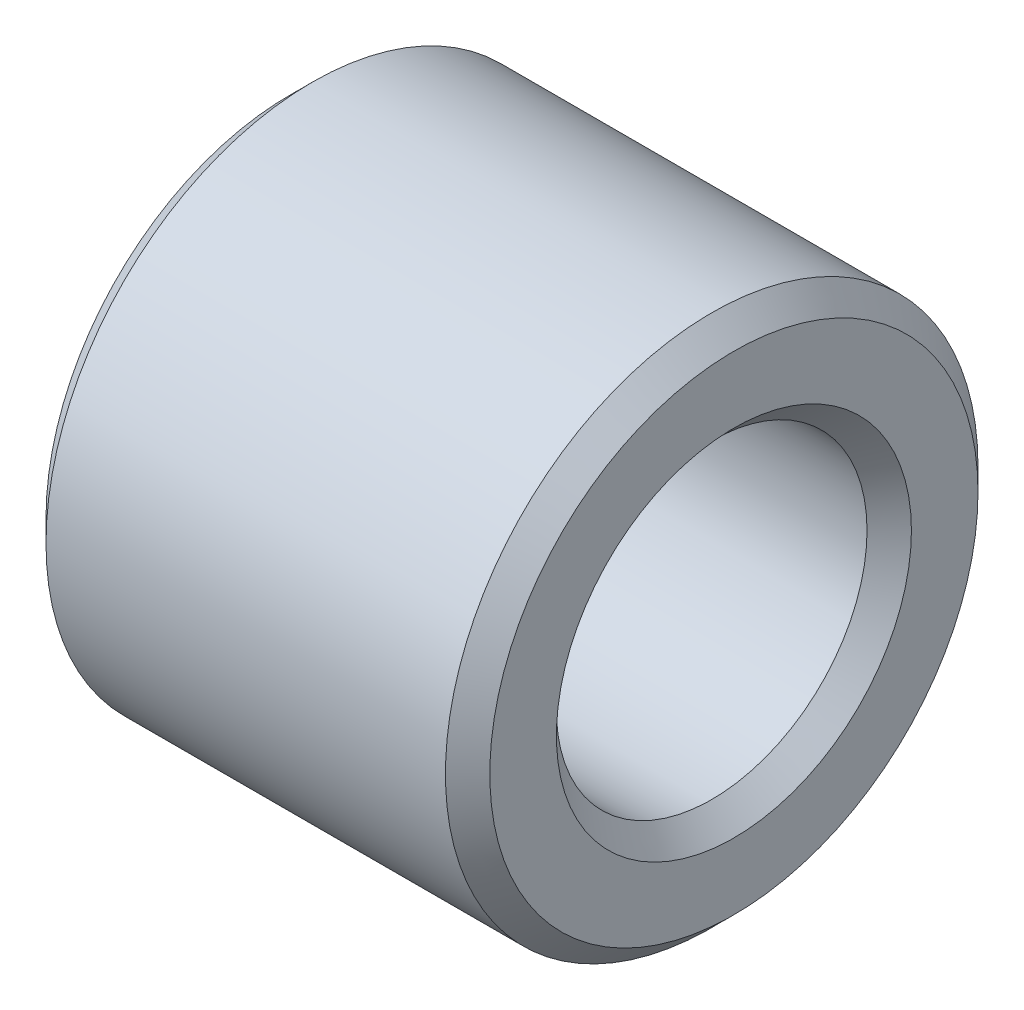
ISO-10303-21;
HEADER;
FILE_DESCRIPTION(('STEP AP214'),'2;1');
FILE_NAME('part.step','',(''),(''),'','','');
FILE_SCHEMA(('AUTOMOTIVE_DESIGN { 1 0 10303 214 1 1 1 1 }'));
ENDSEC;
DATA;
#1=APPLICATION_CONTEXT('core data for automotive mechanical design processes');
#2=APPLICATION_PROTOCOL_DEFINITION('international standard','automotive_design',2000,#1);
#3=PRODUCT_CONTEXT('',#1,'mechanical');
#4=PRODUCT('Part','Part','',(#3));
#5=PRODUCT_RELATED_PRODUCT_CATEGORY('part','',(#4));
#6=PRODUCT_DEFINITION_FORMATION('','',#4);
#7=PRODUCT_DEFINITION_CONTEXT('part definition',#1,'design');
#8=PRODUCT_DEFINITION('design','',#6,#7);
#9=PRODUCT_DEFINITION_SHAPE('','',#8);
#10=(LENGTH_UNIT() NAMED_UNIT(*) SI_UNIT(.MILLI.,.METRE.));
#11=(NAMED_UNIT(*) PLANE_ANGLE_UNIT() SI_UNIT($,.RADIAN.));
#12=(NAMED_UNIT(*) SI_UNIT($,.STERADIAN.) SOLID_ANGLE_UNIT());
#13=UNCERTAINTY_MEASURE_WITH_UNIT(LENGTH_MEASURE(1.E-05),#10,'distance_accuracy_value','');
#14=(GEOMETRIC_REPRESENTATION_CONTEXT(3) GLOBAL_UNCERTAINTY_ASSIGNED_CONTEXT((#13)) GLOBAL_UNIT_ASSIGNED_CONTEXT((#10,
#11,#12)) REPRESENTATION_CONTEXT('',''));
#15=CARTESIAN_POINT('',(0.,0.,0.));
#16=DIRECTION('',(0.,0.,1.));
#17=DIRECTION('',(1.,0.,0.));
#18=AXIS2_PLACEMENT_3D('',#15,#16,#17);
#19=CARTESIAN_POINT('',(0.,3.5,0.));
#20=DIRECTION('',(1.,0.,0.));
#21=DIRECTION('',(0.,0.,-1.));
#22=AXIS2_PLACEMENT_3D('',#19,#20,#21);
#23=PLANE('',#22);
#24=CARTESIAN_POINT('',(0.,0.,0.));
#25=DIRECTION('',(1.,0.,0.));
#26=DIRECTION('',(0.,0.,-1.));
#27=AXIS2_PLACEMENT_3D('',#24,#25,#26);
#28=CIRCLE('',#27,5.5);
#29=CARTESIAN_POINT('',(0.,0.,-5.5));
#30=VERTEX_POINT('',#29);
#31=EDGE_CURVE('E10',#30,#30,#28,.T.);
#32=ORIENTED_EDGE('',*,*,#31,.T.);
#33=EDGE_LOOP('',(#32));
#34=FACE_BOUND('',#33,.T.);
#35=CARTESIAN_POINT('',(0.,0.,0.));
#36=DIRECTION('',(1.,0.,0.));
#37=DIRECTION('',(0.,0.,-1.));
#38=AXIS2_PLACEMENT_3D('',#35,#36,#37);
#39=CIRCLE('',#38,4.);
#40=CARTESIAN_POINT('',(0.,0.,-4.));
#41=VERTEX_POINT('',#40);
#42=EDGE_CURVE('E42',#41,#41,#39,.F.);
#43=ORIENTED_EDGE('',*,*,#42,.T.);
#44=EDGE_LOOP('',(#43));
#45=FACE_BOUND('',#44,.T.);
#46=ADVANCED_FACE('F35',(#34,#45),#23,.T.);
#47=CARTESIAN_POINT('',(0.,0.,0.));
#48=DIRECTION('',(1.,0.,0.));
#49=DIRECTION('',(0.,0.,-1.));
#50=AXIS2_PLACEMENT_3D('',#47,#48,#49);
#51=CYLINDRICAL_SURFACE('',#50,6.);
#52=CARTESIAN_POINT('',(-9.5,0.,0.));
#53=DIRECTION('',(-1.,0.,0.));
#54=DIRECTION('',(0.,0.,1.));
#55=AXIS2_PLACEMENT_3D('',#52,#53,#54);
#56=CIRCLE('',#55,6.);
#57=CARTESIAN_POINT('',(-9.5,0.,6.));
#58=VERTEX_POINT('',#57);
#59=EDGE_CURVE('E46',#58,#58,#56,.F.);
#60=ORIENTED_EDGE('',*,*,#59,.T.);
#61=EDGE_LOOP('',(#60));
#62=FACE_BOUND('',#61,.T.);
#63=CARTESIAN_POINT('',(-0.499999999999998,0.,0.));
#64=DIRECTION('',(1.,0.,0.));
#65=DIRECTION('',(0.,0.,-1.));
#66=AXIS2_PLACEMENT_3D('',#63,#64,#65);
#67=CIRCLE('',#66,6.);
#68=CARTESIAN_POINT('',(-0.499999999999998,0.,-6.));
#69=VERTEX_POINT('',#68);
#70=EDGE_CURVE('E50',#69,#69,#67,.F.);
#71=ORIENTED_EDGE('',*,*,#70,.T.);
#72=EDGE_LOOP('',(#71));
#73=FACE_BOUND('',#72,.T.);
#74=ADVANCED_FACE('F78',(#62,#73),#51,.T.);
#75=CARTESIAN_POINT('',(-10.,3.5,0.));
#76=DIRECTION('',(-1.,0.,0.));
#77=DIRECTION('',(0.,0.,1.));
#78=AXIS2_PLACEMENT_3D('',#75,#76,#77);
#79=PLANE('',#78);
#80=CARTESIAN_POINT('',(-10.,0.,0.));
#81=DIRECTION('',(-1.,0.,0.));
#82=DIRECTION('',(0.,0.,1.));
#83=AXIS2_PLACEMENT_3D('',#80,#81,#82);
#84=CIRCLE('',#83,4.);
#85=CARTESIAN_POINT('',(-10.,0.,4.));
#86=VERTEX_POINT('',#85);
#87=EDGE_CURVE('E61',#86,#86,#84,.F.);
#88=ORIENTED_EDGE('',*,*,#87,.T.);
#89=EDGE_LOOP('',(#88));
#90=FACE_BOUND('',#89,.T.);
#91=CARTESIAN_POINT('',(-10.,0.,0.));
#92=DIRECTION('',(-1.,0.,0.));
#93=DIRECTION('',(0.,0.,1.));
#94=AXIS2_PLACEMENT_3D('',#91,#92,#93);
#95=CIRCLE('',#94,5.5);
#96=CARTESIAN_POINT('',(-10.,0.,5.5));
#97=VERTEX_POINT('',#96);
#98=EDGE_CURVE('E64',#97,#97,#95,.T.);
#99=ORIENTED_EDGE('',*,*,#98,.T.);
#100=EDGE_LOOP('',(#99));
#101=FACE_BOUND('',#100,.T.);
#102=ADVANCED_FACE('F68',(#90,#101),#79,.T.);
#103=CARTESIAN_POINT('',(0.,0.,0.));
#104=DIRECTION('',(1.,0.,0.));
#105=DIRECTION('',(0.,0.,-1.));
#106=AXIS2_PLACEMENT_3D('',#103,#104,#105);
#107=CYLINDRICAL_SURFACE('',#106,3.5);
#108=CARTESIAN_POINT('',(-9.5,0.,0.));
#109=DIRECTION('',(-1.,0.,0.));
#110=DIRECTION('',(0.,0.,1.));
#111=AXIS2_PLACEMENT_3D('',#108,#109,#110);
#112=CIRCLE('',#111,3.5);
#113=CARTESIAN_POINT('',(-9.5,0.,3.5));
#114=VERTEX_POINT('',#113);
#115=EDGE_CURVE('E55',#114,#114,#112,.T.);
#116=ORIENTED_EDGE('',*,*,#115,.T.);
#117=EDGE_LOOP('',(#116));
#118=FACE_BOUND('',#117,.T.);
#119=CARTESIAN_POINT('',(-0.5,0.,0.));
#120=DIRECTION('',(1.,0.,0.));
#121=DIRECTION('',(0.,0.,-1.));
#122=AXIS2_PLACEMENT_3D('',#119,#120,#121);
#123=CIRCLE('',#122,3.5);
#124=CARTESIAN_POINT('',(-0.5,0.,-3.5));
#125=VERTEX_POINT('',#124);
#126=EDGE_CURVE('E58',#125,#125,#123,.T.);
#127=ORIENTED_EDGE('',*,*,#126,.T.);
#128=EDGE_LOOP('',(#127));
#129=FACE_BOUND('',#128,.T.);
#130=ADVANCED_FACE('F97',(#118,#129),#107,.F.);
#131=CARTESIAN_POINT('',(-10.,0.,0.));
#132=DIRECTION('',(-1.,0.,0.));
#133=DIRECTION('',(0.,0.,1.));
#134=AXIS2_PLACEMENT_3D('',#131,#132,#133);
#135=CONICAL_SURFACE('',#134,4.,0.785398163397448);
#136=ORIENTED_EDGE('',*,*,#115,.F.);
#137=EDGE_LOOP('',(#136));
#138=FACE_BOUND('',#137,.T.);
#139=ORIENTED_EDGE('',*,*,#87,.F.);
#140=EDGE_LOOP('',(#139));
#141=FACE_BOUND('',#140,.T.);
#142=ADVANCED_FACE('F74',(#138,#141),#135,.F.);
#143=CARTESIAN_POINT('',(-9.5,0.,0.));
#144=DIRECTION('',(1.,0.,0.));
#145=DIRECTION('',(0.,0.,-1.));
#146=AXIS2_PLACEMENT_3D('',#143,#144,#145);
#147=CONICAL_SURFACE('',#146,6.,0.785398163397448);
#148=ORIENTED_EDGE('',*,*,#98,.F.);
#149=EDGE_LOOP('',(#148));
#150=FACE_BOUND('',#149,.T.);
#151=ORIENTED_EDGE('',*,*,#59,.F.);
#152=EDGE_LOOP('',(#151));
#153=FACE_BOUND('',#152,.T.);
#154=ADVANCED_FACE('F70',(#150,#153),#147,.T.);
#155=CARTESIAN_POINT('',(0.,0.,0.));
#156=DIRECTION('',(-1.,0.,0.));
#157=DIRECTION('',(0.,0.,1.));
#158=AXIS2_PLACEMENT_3D('',#155,#156,#157);
#159=CONICAL_SURFACE('',#158,5.5,0.785398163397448);
#160=ORIENTED_EDGE('',*,*,#70,.F.);
#161=EDGE_LOOP('',(#160));
#162=FACE_BOUND('',#161,.T.);
#163=ORIENTED_EDGE('',*,*,#31,.F.);
#164=EDGE_LOOP('',(#163));
#165=FACE_BOUND('',#164,.T.);
#166=ADVANCED_FACE('F73',(#162,#165),#159,.T.);
#167=CARTESIAN_POINT('',(-0.5,0.,0.));
#168=DIRECTION('',(1.,0.,0.));
#169=DIRECTION('',(0.,0.,-1.));
#170=AXIS2_PLACEMENT_3D('',#167,#168,#169);
#171=CONICAL_SURFACE('',#170,3.5,0.785398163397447);
#172=ORIENTED_EDGE('',*,*,#42,.F.);
#173=EDGE_LOOP('',(#172));
#174=FACE_BOUND('',#173,.T.);
#175=ORIENTED_EDGE('',*,*,#126,.F.);
#176=EDGE_LOOP('',(#175));
#177=FACE_BOUND('',#176,.T.);
#178=ADVANCED_FACE('F37',(#174,#177),#171,.F.);
#179=CLOSED_SHELL('',(#46,#74,#102,#130,#142,#154,#166,#178));
#180=MANIFOLD_SOLID_BREP('B2',#179);
#181=ADVANCED_BREP_SHAPE_REPRESENTATION('',(#18,#180),#14);
#182=SHAPE_DEFINITION_REPRESENTATION(#9,#181);
ENDSEC;
END-ISO-10303-21;
